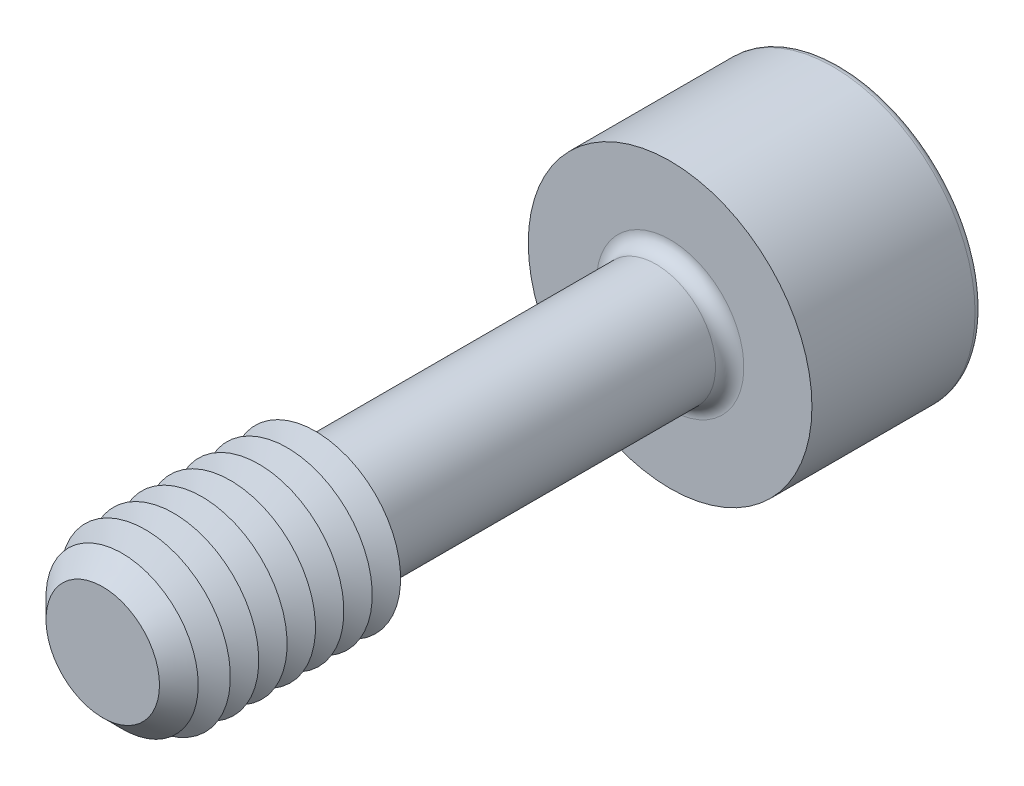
from build123d import *

# Parameters (mm, degrees)
SKETCH1_R       = 2.1
EXTRUDE1_DEPTH  = 10
CHAMFER1_SIZE   = 1
SKETCH3_R       = 5
EXTRUDE2_DEPTH  = 6
EXTRUDE3_DEPTH  = 5
FILLET1_R       = 0.5
FILLET2_R       = 0.25
LPATTERN1_COUNT = 7
LPATTERN1_PITCH = 1


with BuildPart() as part:
    # Sketch1 → Extrude1 (new, symmetric)
    with BuildSketch(Plane.XY):
        Circle(SKETCH1_R)
    extrude(amount=EXTRUDE1_DEPTH, both=True)

    # Sketch2 → Revolve1 (revolve)
    with BuildSketch(Plane(origin=(0, 0, 0), x_dir=(0, 0, -1), z_dir=(1, 0, 0))):
        Polygon((-10, 0), (-10, 3), (-2.5, 3), (-1.980384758, 2.1), (-1.980384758, 0), align=None)
    revolve(axis=Axis((0, 0, 1.980384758), (0, 0, 1)))

    # Chamfer1
    chamfer1_edges = [part.edges().sort_by_distance(p)[0] for p in [
        (0, -3, 10),
    ]]
    chamfer(chamfer1_edges, length=CHAMFER1_SIZE)

    # Sketch3 → Extrude2 (add)
    with BuildSketch(Plane(origin=(0, 0, -10), x_dir=(-1, 0, 0), z_dir=(0, 0, -1))):
        Circle(SKETCH3_R)
    extrude(amount=EXTRUDE2_DEPTH)

    # Sketch4 → Extrude3 (cut)
    with BuildSketch(Plane(origin=(-13.7, 0, -16), x_dir=(1, 0, 0), z_dir=(0, 0, 1))):
        Polygon((12.256624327, -2.5), (15.143375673, -2.5), (16.586751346, 0), (15.143375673, 2.5), (12.256624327, 2.5), (10.813248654, 0), align=None)
    extrude(amount=EXTRUDE3_DEPTH, mode=Mode.SUBTRACT)

    # Fillet1
    fillet1_edges = [part.edges().sort_by_distance(p)[0] for p in [
        (-2.1, 0, -10),
    ]]
    fillet(fillet1_edges, radius=FILLET1_R)

    # Fillet2
    fillet2_edges = [part.edges().sort_by_distance(p)[0] for p in [
        (5, 0, -16),
    ]]
    fillet(fillet2_edges, radius=FILLET2_R)

    # Sketch5 → Cut-Revolve1 (revolve, cut)
    with BuildSketch(Plane(origin=(0, 0, 0), x_dir=(0, 0, -1), z_dir=(1, 0, 0)), mode=Mode.PRIVATE) as cut_revolve1_sk:
        Polygon((11, 0), (11, -2.5), (9.556624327, 0), align=None)
    revolve(cut_revolve1_sk.sketch.rotate(Axis((0, 0, -9.556624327), (0, 0, -1)), 90), axis=Axis((0, 0, -9.556624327), (0, 0, -1)), mode=Mode.SUBTRACT)

    # Sketch7 → Cut-Revolve2 (revolve, cut)
    with BuildSketch(Plane(origin=(0, 0, 0), x_dir=(0, 0, -1), z_dir=(1, 0, 0)), mode=Mode.PRIVATE) as cut_revolve2_sk:
        Polygon((-2.5, 3), (-3, 2.133974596), (-3.5, 3), align=None)
    cut_revolve2 = revolve(cut_revolve2_sk.sketch.rotate(Axis((0, 0, -1.332048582), (0, 0, 1)), 90), axis=Axis((0, 0, -1.332048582), (0, 0, 1)), mode=Mode.SUBTRACT)

    # LPattern1: Cut-Revolve2 ×7
    with Locations(*[(0, 0, i * LPATTERN1_PITCH) for i in range(1, LPATTERN1_COUNT)]):
        add(cut_revolve2, mode=Mode.SUBTRACT)


solid = part.part
